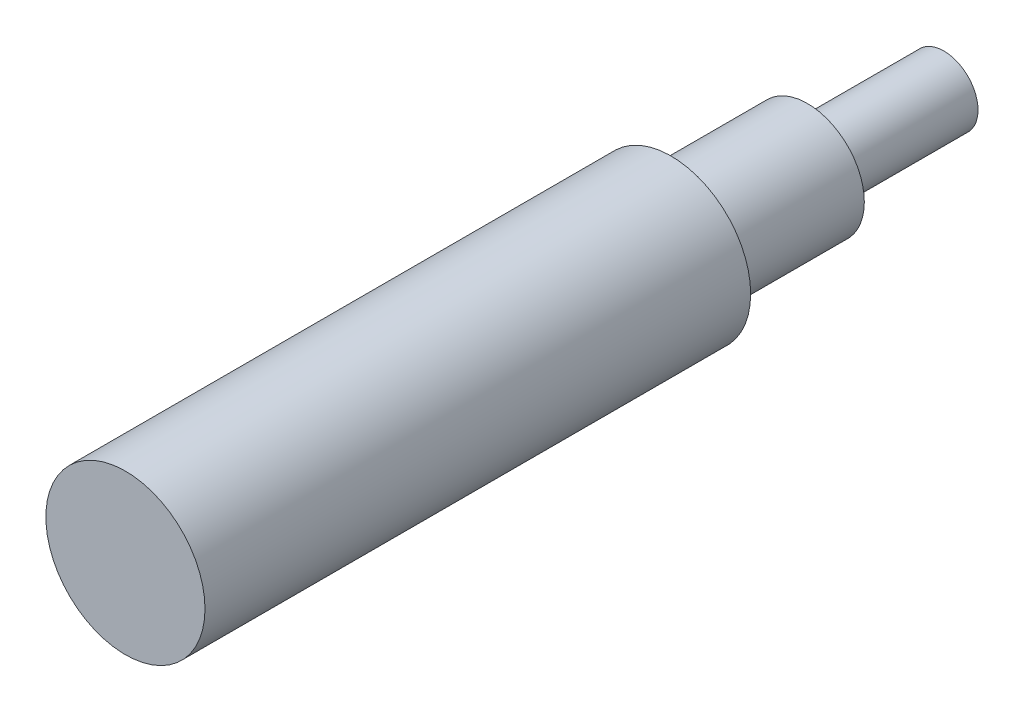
from build123d import *

# Parameters (mm, degrees)
CROQUIS2_R              = 12.5
SALIENTE_EXTRUIR1_DEPTH = 150
CROQUIS4_R              = 7.5
SALIENTE_EXTRUIR2_DEPTH = 30
CROQUIS5_R              = 6
CORTAR_EXTRUIR1_DEPTH   = 30
CROQUIS6_R              = 17.5
SALIENTE_EXTRUIR3_DEPTH = 120


with BuildPart() as part:
    # Croquis2 → Saliente-Extruir1 (new body)
    with BuildSketch(Plane.XY):
        Circle(CROQUIS2_R)
    extrude(amount=SALIENTE_EXTRUIR1_DEPTH)

    # Croquis4 → Saliente-Extruir2 (add)
    with BuildSketch(Plane(origin=(0, 0, 0), x_dir=(-1, 0, 0), z_dir=(0, 0, -1))):
        with Locations(Location((0, 0, 0), (0, 0, 180))):
            Circle(CROQUIS4_R)
    extrude(amount=SALIENTE_EXTRUIR2_DEPTH)

    # Croquis5 → Cortar-Extruir1 (cut)
    with BuildSketch(Plane(origin=(0, 0, -30), x_dir=(-1, 0, 0), z_dir=(0, 0, -1))):
        Circle(CROQUIS5_R)
    extrude(amount=-CORTAR_EXTRUIR1_DEPTH, mode=Mode.SUBTRACT)

    # Croquis6 → Saliente-Extruir3 (add)
    with BuildSketch(Plane.XY.offset(150)):
        Circle(CROQUIS6_R)
    extrude(amount=-SALIENTE_EXTRUIR3_DEPTH)


solid = part.part
